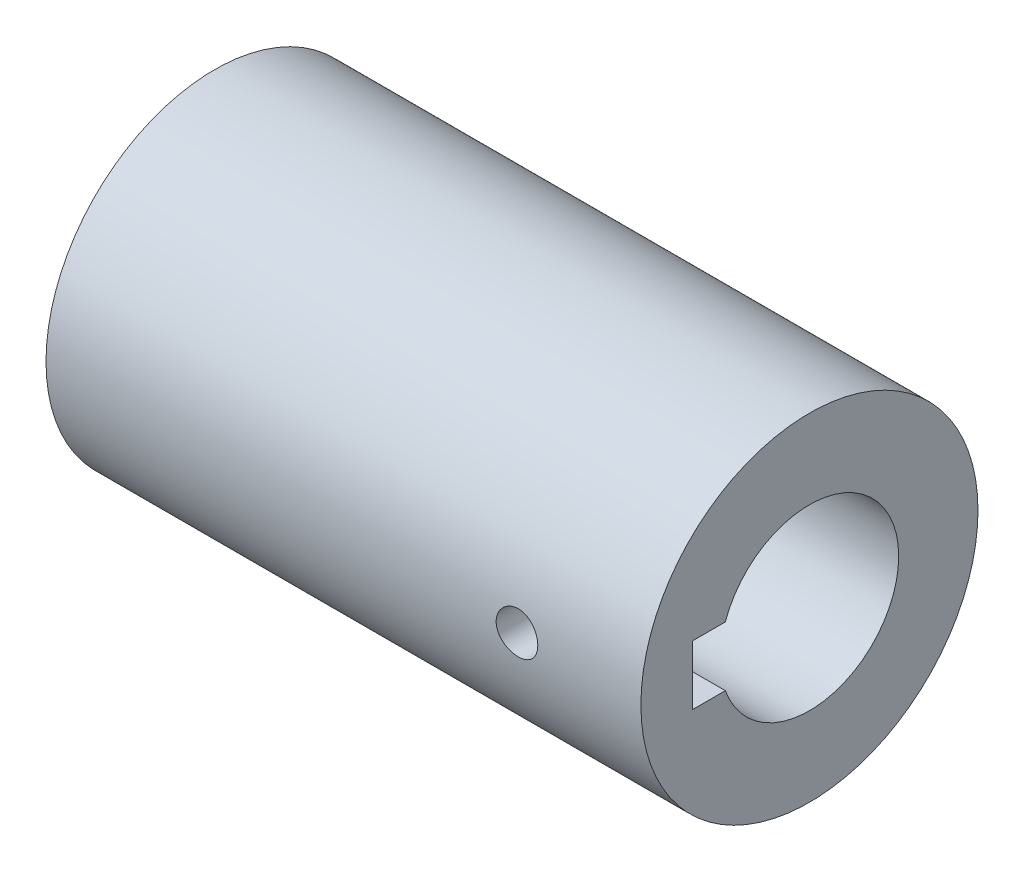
from build123d import *

# Parameters (mm, degrees)
SKETCH1_R                     = 17
COUPLER_BODY_DEPTH            = 30
SKETCH2_R                     = 9
MOTOR_BORE_DEPTH              = 26
SKETCH4_R                     = 6.35
F_5_8_RH_ACME_TAP_DRILL_DEPTH = 26
SKETCH6_W                     = 6
SKETCH6_H                     = 6
KEYWAY_DEPTH                  = 26
M5X0_8_TAPPED_HOLE1_D         = 4.2
M5X0_8_TAPPED_HOLE1_DEPTH     = 5.2


with BuildPart() as part:
    # Sketch1 → Coupler Body (new, symmetric)
    with BuildSketch(Plane.YZ):
        with Locations(Location((0, 0, 0), (0, 0, 270))):
            Circle(SKETCH1_R)
    extrude(amount=COUPLER_BODY_DEPTH, both=True)

    # Sketch2 → Motor Bore (cut)
    with BuildSketch(Plane.YZ.offset(30)):
        with Locations(Location((0, 0, 0), (0, 0, 270))):
            Circle(SKETCH2_R)
    extrude(amount=-MOTOR_BORE_DEPTH, mode=Mode.SUBTRACT)

    # Sketch4 → 5-8 RH ACME - Tap Drill (cut)
    with BuildSketch(Plane(origin=(-30, 0, 0), x_dir=(0, -1, 0), z_dir=(-1, 0, 0))):
        with Locations(Location((0, 0, 0), (0, 0, 90))):
            Circle(SKETCH4_R)
    extrude(amount=-F_5_8_RH_ACME_TAP_DRILL_DEPTH, mode=Mode.SUBTRACT)

    # Sketch6 → Keyway (cut)
    with BuildSketch(Plane.YZ.offset(30)):
        with Locations((0, 8.8)):
            Rectangle(SKETCH6_W, SKETCH6_H)
    extrude(amount=-KEYWAY_DEPTH, mode=Mode.SUBTRACT)

    # M5x0.8 Tapped Hole1
    with Locations(Plane(origin=(0, 0, 17), x_dir=(0, -1, 0), z_dir=(0, 0, 1))):
        with Locations((0, 17.5)):
            Hole(M5X0_8_TAPPED_HOLE1_D / 2, depth=M5X0_8_TAPPED_HOLE1_DEPTH)


solid = part.part
